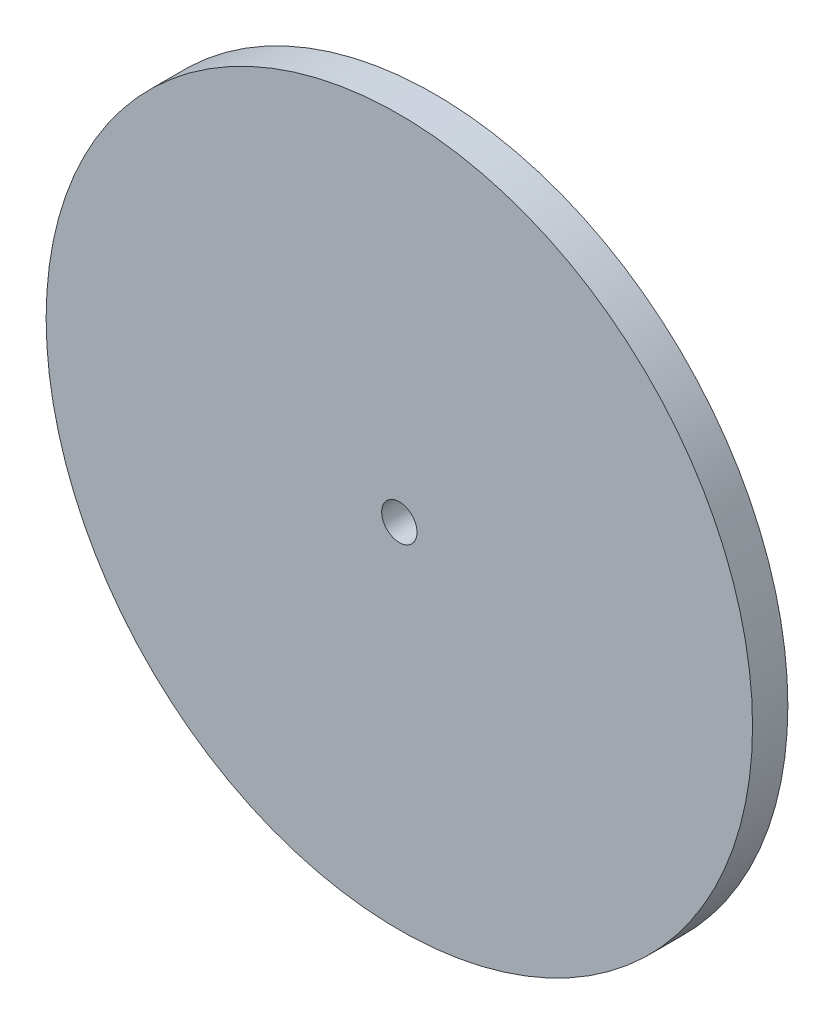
from build123d import *

# Parameters (mm, degrees)
SKETCH_3_R      = 300
SKETCH_3_R_2    = 15
EXTRUDE_1_DEPTH = 30


with BuildPart() as part:
    # Sketch 3 → Extrude 1 (new body)
    with BuildSketch(Plane.XY):
        Circle(SKETCH_3_R)
        Circle(SKETCH_3_R_2, mode=Mode.SUBTRACT)
    extrude(amount=EXTRUDE_1_DEPTH)


solid = part.part
